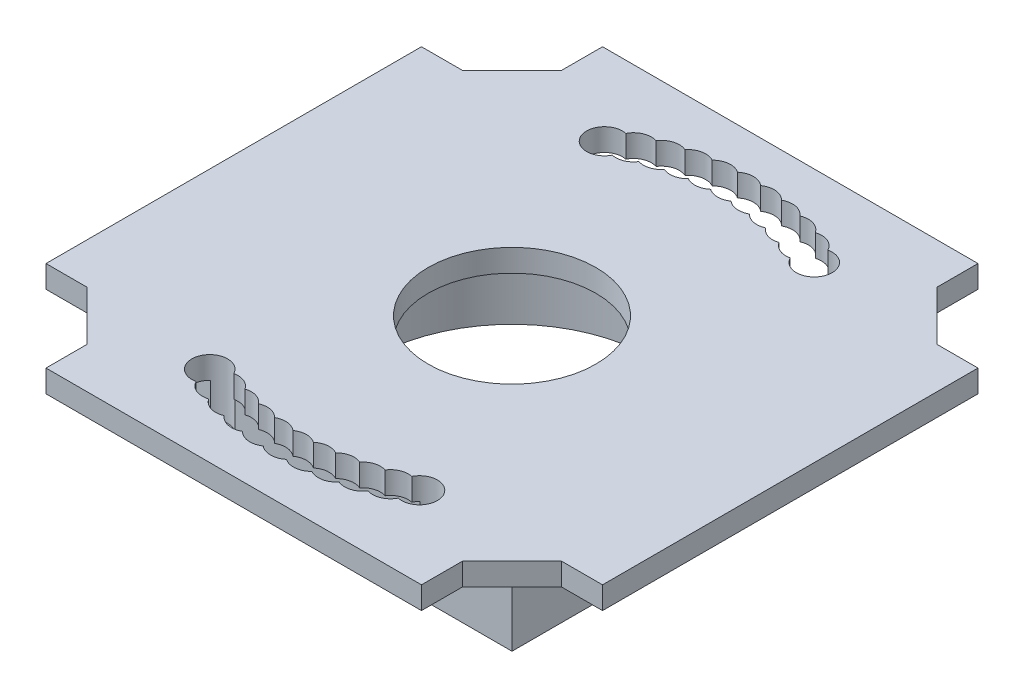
from build123d import *

# Parameters (mm, degrees)
SKETCH1_R               = 12.5
SKETCH1_R_2             = 7.5
BOSS_EXTRUDE1_DEPTH     = 9.5
SKETCH5_W               = 49.8
SKETCH5_H               = 49.8
SKETCH5_W_2             = 33
SKETCH5_H_2             = 33
CUT_EXTRUDE4_DEPTH      = 7.5
CUT_EXTRUDE1_START      = -9.5
SKETCH1_3_R             = 12.5
CUT_EXTRUDE1_DEPTH      = 7.5
CUT_EXTRUDE3_DEPTH      = 37.472866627
CUT_EXTRUDE3_DEPTH_BACK = 5
SKETCH4_R               = 1.6


with BuildPart() as part:
    # Sketch1 → Boss-Extrude1 (new body)
    # profile 1 of 2: a face of its own
    with BuildSketch(Plane(origin=(0, 0, 0), x_dir=(1, 0, 0), z_dir=(0, 1, 0))):
        Polygon((16.799369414, 24.9), (-16.799369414, 24.9), (-16.799369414, 21.24), (-21.24, 16.799369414), (-24.9, 16.799369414), (-24.9, -16.799369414), (-21.24, -16.799369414), (-16.799369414, -21.24), (-16.799369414, -24.9), (16.799369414, -24.9), (16.799369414, -21.24), (21.24, -16.799369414), (24.9, -16.799369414), (24.9, 16.799369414), (21.24, 16.799369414), (16.799369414, 21.24), align=None)
        Circle(SKETCH1_R, mode=Mode.SUBTRACT)
    # profile 2 of 2: a face of its own
    with BuildSketch(Plane(origin=(0, 0, 0), x_dir=(1, 0, 0), z_dir=(0, 1, 0))):
        Circle(SKETCH1_R)
        with Locations(Location((0, 0, 0), (0, 0, 270))):
            Circle(SKETCH1_R_2, mode=Mode.SUBTRACT)
    extrude(amount=-BOSS_EXTRUDE1_DEPTH)

    # Sketch5 → Cut-Extrude4 (cut)
    with BuildSketch(Plane(origin=(0, -9.5, 0), x_dir=(-1, 0, 0), z_dir=(0, -1, 0))):
        Rectangle(SKETCH5_W, SKETCH5_H)
        Rectangle(SKETCH5_W_2, SKETCH5_H_2, mode=Mode.SUBTRACT)
    extrude(amount=-CUT_EXTRUDE4_DEPTH, mode=Mode.SUBTRACT)

    # Sketch1_3 → Cut-Extrude1 (cut)
    with BuildSketch(Plane(origin=(0, 0, 0), x_dir=(1, 0, 0), z_dir=(0, 1, 0)).offset(CUT_EXTRUDE1_START)):
        with Locations(Location((0, 0, 0), (0, 0, 270))):
            Circle(SKETCH1_3_R)
    extrude(amount=CUT_EXTRUDE1_DEPTH, mode=Mode.SUBTRACT)

    # Sketch4 → Cut-Extrude3 (cut, two sides: drawn at the far end of the back side and taken through both)
    with BuildSketch(Plane(origin=(0, 0, 0), x_dir=(1, 0, 0), z_dir=(0, 1, 0)).offset(-CUT_EXTRUDE3_DEPTH_BACK)):
        with Locations((1.950741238, -19.904637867)):
            Circle(SKETCH4_R)
        with Locations((3.882879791, -19.619460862)):
            Circle(SKETCH4_R)
        with Locations((0, -20)):
            Circle(SKETCH4_R)
        with Locations((5.777990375, -19.147188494)):
            Circle(SKETCH4_R)
        with Locations((7.61800081, -18.492324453)):
            Circle(SKETCH4_R)
        with Locations((9.385364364, -17.661113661)):
            Circle(SKETCH4_R)
        with Locations((-1.950741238, -19.904637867)):
            Circle(SKETCH4_R)
        with Locations((-3.882879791, -19.619460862)):
            Circle(SKETCH4_R)
        with Locations((-5.777990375, -19.147188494)):
            Circle(SKETCH4_R)
        with Locations((-7.61800081, -18.492324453)):
            Circle(SKETCH4_R)
        with Locations((-9.385364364, -17.661113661)):
            Circle(SKETCH4_R)
        with Locations((5.777990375, 19.147188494)):
            Circle(SKETCH4_R)
        with Locations((7.61800081, 18.492324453)):
            Circle(SKETCH4_R)
        with Locations((9.385364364, 17.661113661)):
            Circle(SKETCH4_R)
        with Locations((3.882879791, 19.619460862)):
            Circle(SKETCH4_R)
        with Locations((1.950741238, 19.904637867)):
            Circle(SKETCH4_R)
        with Locations((0, 20)):
            Circle(SKETCH4_R)
        with Locations((-1.950741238, 19.904637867)):
            Circle(SKETCH4_R)
        with Locations((-3.882879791, 19.619460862)):
            Circle(SKETCH4_R)
        with Locations((-5.777990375, 19.147188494)):
            Circle(SKETCH4_R)
        with Locations((-7.61800081, 18.492324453)):
            Circle(SKETCH4_R)
        with Locations((-9.385364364, 17.661113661)):
            Circle(SKETCH4_R)
    extrude(amount=CUT_EXTRUDE3_DEPTH + CUT_EXTRUDE3_DEPTH_BACK, mode=Mode.SUBTRACT)


solid = part.part
